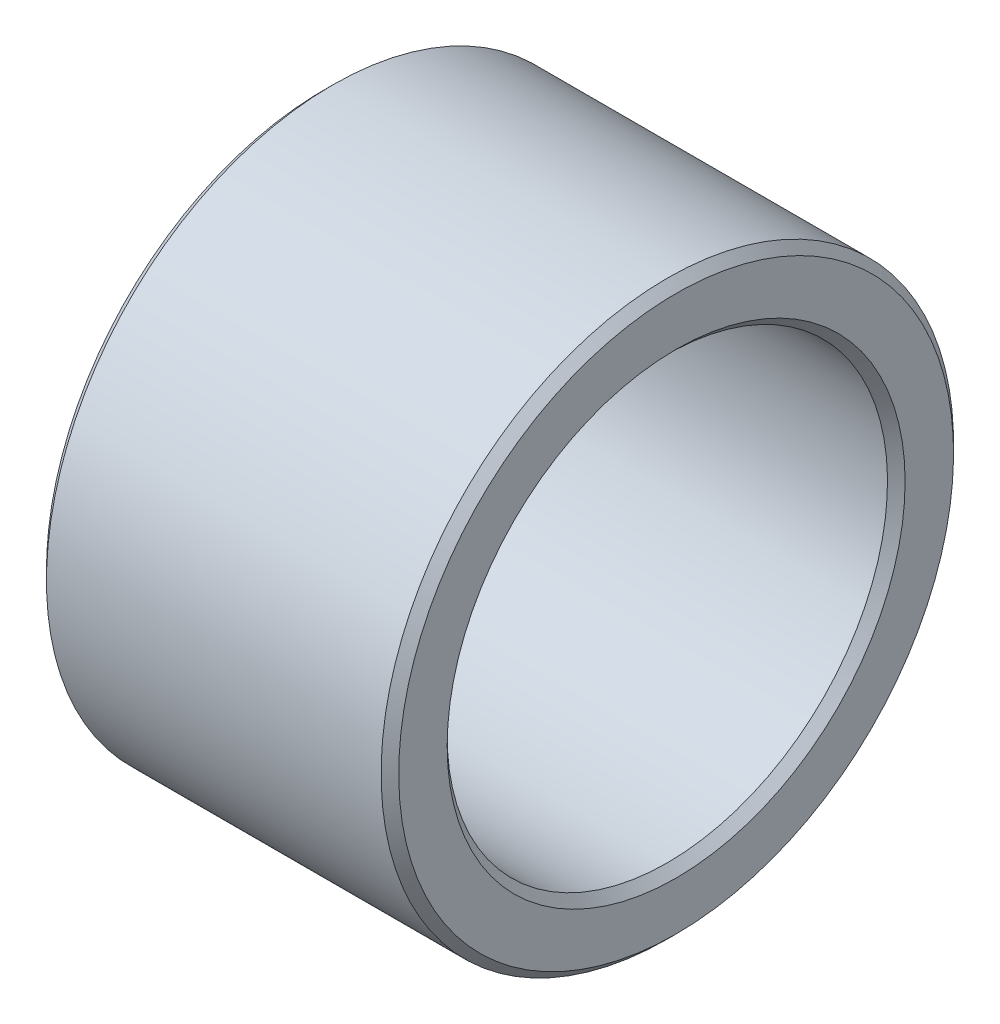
ISO-10303-21;
HEADER;
FILE_DESCRIPTION(('STEP AP214'),'2;1');
FILE_NAME('part.step','',(''),(''),'','','');
FILE_SCHEMA(('AUTOMOTIVE_DESIGN { 1 0 10303 214 1 1 1 1 }'));
ENDSEC;
DATA;
#1=APPLICATION_CONTEXT('core data for automotive mechanical design processes');
#2=APPLICATION_PROTOCOL_DEFINITION('international standard','automotive_design',2000,#1);
#3=PRODUCT_CONTEXT('',#1,'mechanical');
#4=PRODUCT('Part','Part','',(#3));
#5=PRODUCT_RELATED_PRODUCT_CATEGORY('part','',(#4));
#6=PRODUCT_DEFINITION_FORMATION('','',#4);
#7=PRODUCT_DEFINITION_CONTEXT('part definition',#1,'design');
#8=PRODUCT_DEFINITION('design','',#6,#7);
#9=PRODUCT_DEFINITION_SHAPE('','',#8);
#10=(LENGTH_UNIT() NAMED_UNIT(*) SI_UNIT(.MILLI.,.METRE.));
#11=(NAMED_UNIT(*) PLANE_ANGLE_UNIT() SI_UNIT($,.RADIAN.));
#12=(NAMED_UNIT(*) SI_UNIT($,.STERADIAN.) SOLID_ANGLE_UNIT());
#13=UNCERTAINTY_MEASURE_WITH_UNIT(LENGTH_MEASURE(1.E-05),#10,'distance_accuracy_value','');
#14=(GEOMETRIC_REPRESENTATION_CONTEXT(3) GLOBAL_UNCERTAINTY_ASSIGNED_CONTEXT((#13)) GLOBAL_UNIT_ASSIGNED_CONTEXT((#10,
#11,#12)) REPRESENTATION_CONTEXT('',''));
#15=CARTESIAN_POINT('',(0.,0.,0.));
#16=DIRECTION('',(0.,0.,1.));
#17=DIRECTION('',(1.,0.,0.));
#18=AXIS2_PLACEMENT_3D('',#15,#16,#17);
#19=CARTESIAN_POINT('',(0.,-11.5,0.));
#20=DIRECTION('',(-1.,0.,0.));
#21=DIRECTION('',(0.,1.,0.));
#22=AXIS2_PLACEMENT_3D('',#19,#20,#21);
#23=PLANE('',#22);
#24=CARTESIAN_POINT('',(0.,0.,0.));
#25=DIRECTION('',(1.,0.,0.));
#26=DIRECTION('',(0.,-1.,0.));
#27=AXIS2_PLACEMENT_3D('',#24,#25,#26);
#28=CIRCLE('',#27,10.4);
#29=CARTESIAN_POINT('',(0.,-10.4,0.));
#30=VERTEX_POINT('',#29);
#31=EDGE_CURVE('E9',#30,#30,#28,.T.);
#32=ORIENTED_EDGE('',*,*,#31,.T.);
#33=EDGE_LOOP('',(#32));
#34=FACE_BOUND('',#33,.T.);
#35=CARTESIAN_POINT('',(0.,0.,0.));
#36=DIRECTION('',(1.,0.,0.));
#37=DIRECTION('',(0.,-1.,0.));
#38=AXIS2_PLACEMENT_3D('',#35,#36,#37);
#39=CIRCLE('',#38,12.6);
#40=CARTESIAN_POINT('',(0.,-12.6,0.));
#41=VERTEX_POINT('',#40);
#42=EDGE_CURVE('E58',#41,#41,#39,.T.);
#43=ORIENTED_EDGE('',*,*,#42,.F.);
#44=EDGE_LOOP('',(#43));
#45=FACE_BOUND('',#44,.T.);
#46=ADVANCED_FACE('F15',(#34,#45),#23,.T.);
#47=CARTESIAN_POINT('',(0.2,0.,0.));
#48=DIRECTION('',(-1.,0.,0.));
#49=DIRECTION('',(0.,-1.,0.));
#50=AXIS2_PLACEMENT_3D('',#47,#48,#49);
#51=CONICAL_SURFACE('',#50,10.2,0.785398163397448);
#52=CARTESIAN_POINT('',(0.4,0.,0.));
#53=DIRECTION('',(1.,0.,0.));
#54=DIRECTION('',(0.,-1.,0.));
#55=AXIS2_PLACEMENT_3D('',#52,#53,#54);
#56=CIRCLE('',#55,10.);
#57=CARTESIAN_POINT('',(0.4,-10.,0.));
#58=VERTEX_POINT('',#57);
#59=EDGE_CURVE('E23',#58,#58,#56,.T.);
#60=ORIENTED_EDGE('',*,*,#59,.T.);
#61=EDGE_LOOP('',(#60));
#62=FACE_BOUND('',#61,.T.);
#63=ORIENTED_EDGE('',*,*,#31,.F.);
#64=EDGE_LOOP('',(#63));
#65=FACE_BOUND('',#64,.T.);
#66=ADVANCED_FACE('F83',(#62,#65),#51,.F.);
#67=CARTESIAN_POINT('',(8.,0.,0.));
#68=DIRECTION('',(-1.,0.,0.));
#69=DIRECTION('',(0.,-1.,0.));
#70=AXIS2_PLACEMENT_3D('',#67,#68,#69);
#71=CYLINDRICAL_SURFACE('',#70,10.);
#72=CARTESIAN_POINT('',(15.6,0.,0.));
#73=DIRECTION('',(1.,0.,0.));
#74=DIRECTION('',(0.,-1.,0.));
#75=AXIS2_PLACEMENT_3D('',#72,#73,#74);
#76=CIRCLE('',#75,10.);
#77=CARTESIAN_POINT('',(15.6,-10.,0.));
#78=VERTEX_POINT('',#77);
#79=EDGE_CURVE('E47',#78,#78,#76,.T.);
#80=ORIENTED_EDGE('',*,*,#79,.T.);
#81=EDGE_LOOP('',(#80));
#82=FACE_BOUND('',#81,.T.);
#83=ORIENTED_EDGE('',*,*,#59,.F.);
#84=EDGE_LOOP('',(#83));
#85=FACE_BOUND('',#84,.T.);
#86=ADVANCED_FACE('F48',(#82,#85),#71,.F.);
#87=CARTESIAN_POINT('',(15.8,0.,0.));
#88=DIRECTION('',(1.,0.,0.));
#89=DIRECTION('',(0.,-1.,0.));
#90=AXIS2_PLACEMENT_3D('',#87,#88,#89);
#91=CONICAL_SURFACE('',#90,10.2,0.785398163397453);
#92=CARTESIAN_POINT('',(16.,0.,0.));
#93=DIRECTION('',(1.,0.,0.));
#94=DIRECTION('',(0.,-1.,0.));
#95=AXIS2_PLACEMENT_3D('',#92,#93,#94);
#96=CIRCLE('',#95,10.4);
#97=CARTESIAN_POINT('',(16.,-10.4,0.));
#98=VERTEX_POINT('',#97);
#99=EDGE_CURVE('E51',#98,#98,#96,.T.);
#100=ORIENTED_EDGE('',*,*,#99,.T.);
#101=EDGE_LOOP('',(#100));
#102=FACE_BOUND('',#101,.T.);
#103=ORIENTED_EDGE('',*,*,#79,.F.);
#104=EDGE_LOOP('',(#103));
#105=FACE_BOUND('',#104,.T.);
#106=ADVANCED_FACE('F80',(#102,#105),#91,.F.);
#107=CARTESIAN_POINT('',(16.,-11.5,0.));
#108=DIRECTION('',(1.,0.,0.));
#109=DIRECTION('',(0.,-1.,0.));
#110=AXIS2_PLACEMENT_3D('',#107,#108,#109);
#111=PLANE('',#110);
#112=CARTESIAN_POINT('',(16.,0.,0.));
#113=DIRECTION('',(1.,0.,0.));
#114=DIRECTION('',(0.,-1.,0.));
#115=AXIS2_PLACEMENT_3D('',#112,#113,#114);
#116=CIRCLE('',#115,12.6);
#117=CARTESIAN_POINT('',(16.,-12.6,0.));
#118=VERTEX_POINT('',#117);
#119=EDGE_CURVE('E53',#118,#118,#116,.T.);
#120=ORIENTED_EDGE('',*,*,#119,.T.);
#121=EDGE_LOOP('',(#120));
#122=FACE_BOUND('',#121,.T.);
#123=ORIENTED_EDGE('',*,*,#99,.F.);
#124=EDGE_LOOP('',(#123));
#125=FACE_BOUND('',#124,.T.);
#126=ADVANCED_FACE('F64',(#122,#125),#111,.T.);
#127=CARTESIAN_POINT('',(15.8,0.,0.));
#128=DIRECTION('',(-1.,0.,0.));
#129=DIRECTION('',(0.,-1.,0.));
#130=AXIS2_PLACEMENT_3D('',#127,#128,#129);
#131=CONICAL_SURFACE('',#130,12.8,0.785398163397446);
#132=CARTESIAN_POINT('',(15.6,0.,0.));
#133=DIRECTION('',(1.,0.,0.));
#134=DIRECTION('',(0.,-1.,0.));
#135=AXIS2_PLACEMENT_3D('',#132,#133,#134);
#136=CIRCLE('',#135,13.);
#137=CARTESIAN_POINT('',(15.6,-13.,0.));
#138=VERTEX_POINT('',#137);
#139=EDGE_CURVE('E60',#138,#138,#136,.T.);
#140=ORIENTED_EDGE('',*,*,#139,.T.);
#141=EDGE_LOOP('',(#140));
#142=FACE_BOUND('',#141,.T.);
#143=ORIENTED_EDGE('',*,*,#119,.F.);
#144=EDGE_LOOP('',(#143));
#145=FACE_BOUND('',#144,.T.);
#146=ADVANCED_FACE('F67',(#142,#145),#131,.T.);
#147=CARTESIAN_POINT('',(8.,0.,0.));
#148=DIRECTION('',(-1.,0.,0.));
#149=DIRECTION('',(0.,-1.,0.));
#150=AXIS2_PLACEMENT_3D('',#147,#148,#149);
#151=CYLINDRICAL_SURFACE('',#150,13.);
#152=CARTESIAN_POINT('',(0.4,0.,0.));
#153=DIRECTION('',(1.,0.,0.));
#154=DIRECTION('',(0.,-1.,0.));
#155=AXIS2_PLACEMENT_3D('',#152,#153,#154);
#156=CIRCLE('',#155,13.);
#157=CARTESIAN_POINT('',(0.4,-13.,0.));
#158=VERTEX_POINT('',#157);
#159=EDGE_CURVE('E56',#158,#158,#156,.T.);
#160=ORIENTED_EDGE('',*,*,#159,.T.);
#161=EDGE_LOOP('',(#160));
#162=FACE_BOUND('',#161,.T.);
#163=ORIENTED_EDGE('',*,*,#139,.F.);
#164=EDGE_LOOP('',(#163));
#165=FACE_BOUND('',#164,.T.);
#166=ADVANCED_FACE('F69',(#162,#165),#151,.T.);
#167=CARTESIAN_POINT('',(0.2,0.,0.));
#168=DIRECTION('',(1.,0.,0.));
#169=DIRECTION('',(0.,-1.,0.));
#170=AXIS2_PLACEMENT_3D('',#167,#168,#169);
#171=CONICAL_SURFACE('',#170,12.8,0.785398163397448);
#172=ORIENTED_EDGE('',*,*,#42,.T.);
#173=EDGE_LOOP('',(#172));
#174=FACE_BOUND('',#173,.T.);
#175=ORIENTED_EDGE('',*,*,#159,.F.);
#176=EDGE_LOOP('',(#175));
#177=FACE_BOUND('',#176,.T.);
#178=ADVANCED_FACE('F77',(#174,#177),#171,.T.);
#179=CLOSED_SHELL('',(#46,#66,#86,#106,#126,#146,#166,#178));
#180=MANIFOLD_SOLID_BREP('B1',#179);
#181=ADVANCED_BREP_SHAPE_REPRESENTATION('',(#18,#180),#14);
#182=SHAPE_DEFINITION_REPRESENTATION(#9,#181);
ENDSEC;
END-ISO-10303-21;
